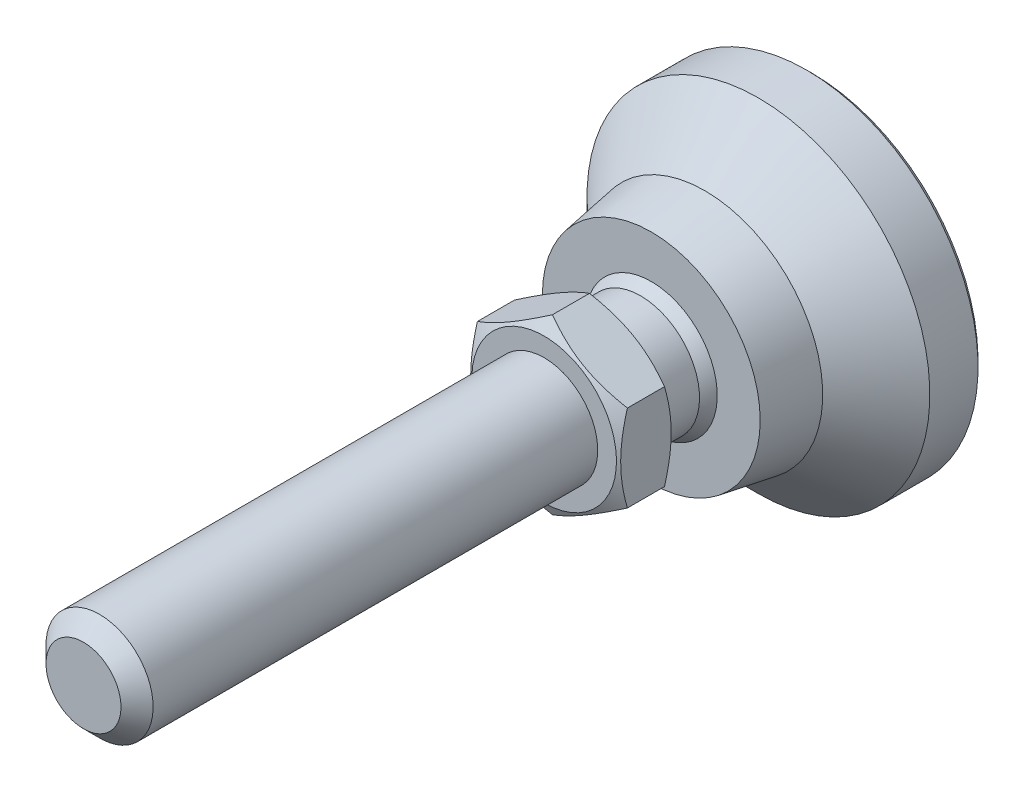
ISO-10303-21;
HEADER;
FILE_DESCRIPTION(('STEP AP214'),'2;1');
FILE_NAME('part.step','',(''),(''),'','','');
FILE_SCHEMA(('AUTOMOTIVE_DESIGN { 1 0 10303 214 1 1 1 1 }'));
ENDSEC;
DATA;
#1=APPLICATION_CONTEXT('core data for automotive mechanical design processes');
#2=APPLICATION_PROTOCOL_DEFINITION('international standard','automotive_design',2000,#1);
#3=PRODUCT_CONTEXT('',#1,'mechanical');
#4=PRODUCT('Part','Part','',(#3));
#5=PRODUCT_RELATED_PRODUCT_CATEGORY('part','',(#4));
#6=PRODUCT_DEFINITION_FORMATION('','',#4);
#7=PRODUCT_DEFINITION_CONTEXT('part definition',#1,'design');
#8=PRODUCT_DEFINITION('design','',#6,#7);
#9=PRODUCT_DEFINITION_SHAPE('','',#8);
#10=(LENGTH_UNIT() NAMED_UNIT(*) SI_UNIT(.MILLI.,.METRE.));
#11=(NAMED_UNIT(*) PLANE_ANGLE_UNIT() SI_UNIT($,.RADIAN.));
#12=(NAMED_UNIT(*) SI_UNIT($,.STERADIAN.) SOLID_ANGLE_UNIT());
#13=UNCERTAINTY_MEASURE_WITH_UNIT(LENGTH_MEASURE(1.E-05),#10,'distance_accuracy_value','');
#14=(GEOMETRIC_REPRESENTATION_CONTEXT(3) GLOBAL_UNCERTAINTY_ASSIGNED_CONTEXT((#13)) GLOBAL_UNIT_ASSIGNED_CONTEXT((#10,
#11,#12)) REPRESENTATION_CONTEXT('',''));
#15=CARTESIAN_POINT('',(0.,0.,0.));
#16=DIRECTION('',(0.,0.,1.));
#17=DIRECTION('',(1.,0.,0.));
#18=AXIS2_PLACEMENT_3D('',#15,#16,#17);
#19=CARTESIAN_POINT('',(0.,0.,0.));
#20=DIRECTION('',(0.,0.,-1.));
#21=DIRECTION('',(0.,1.,0.));
#22=AXIS2_PLACEMENT_3D('',#19,#20,#21);
#23=CYLINDRICAL_SURFACE('',#22,5.49999999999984);
#24=CARTESIAN_POINT('',(0.,0.,20.));
#25=DIRECTION('',(0.,0.,-1.));
#26=DIRECTION('',(0.,1.,0.));
#27=AXIS2_PLACEMENT_3D('',#24,#25,#26);
#28=CIRCLE('',#27,5.49999999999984);
#29=CARTESIAN_POINT('',(0.,5.49999999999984,20.));
#30=VERTEX_POINT('',#29);
#31=EDGE_CURVE('E112',#30,#30,#28,.T.);
#32=ORIENTED_EDGE('',*,*,#31,.T.);
#33=EDGE_LOOP('',(#32));
#34=FACE_BOUND('',#33,.T.);
#35=CARTESIAN_POINT('',(0.,0.,16.0000000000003));
#36=DIRECTION('',(0.,0.,1.));
#37=DIRECTION('',(0.,-1.,0.));
#38=AXIS2_PLACEMENT_3D('',#35,#36,#37);
#39=CIRCLE('',#38,5.49999999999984);
#40=CARTESIAN_POINT('',(-5.49999999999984,0.,16.0000000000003));
#41=VERTEX_POINT('',#40);
#42=EDGE_CURVE('E115',#41,#41,#39,.T.);
#43=ORIENTED_EDGE('',*,*,#42,.T.);
#44=EDGE_LOOP('',(#43));
#45=FACE_BOUND('',#44,.T.);
#46=ADVANCED_FACE('F14',(#34,#45),#23,.T.);
#47=CARTESIAN_POINT('',(0.,0.,11.6698729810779));
#48=DIRECTION('',(0.,0.,1.));
#49=DIRECTION('',(-1.,0.,0.));
#50=AXIS2_PLACEMENT_3D('',#47,#48,#49);
#51=SPHERICAL_SURFACE('',#50,7.);
#52=CARTESIAN_POINT('',(0.,0.,15.));
#53=DIRECTION('',(0.,0.,1.));
#54=DIRECTION('',(0.,-1.,0.));
#55=AXIS2_PLACEMENT_3D('',#52,#53,#54);
#56=CIRCLE('',#55,6.15713034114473);
#57=CARTESIAN_POINT('',(-6.15713034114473,0.,15.));
#58=VERTEX_POINT('',#57);
#59=EDGE_CURVE('E276',#58,#58,#56,.T.);
#60=CARTESIAN_POINT('',(-5.49999999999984,0.,16.0000000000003));
#61=CARTESIAN_POINT('',(-5.50771979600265,0.,15.9901945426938));
#62=CARTESIAN_POINT('',(-5.51541336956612,0.,15.9803684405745));
#63=CARTESIAN_POINT('',(-5.53074785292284,0.,15.9606752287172));
#64=CARTESIAN_POINT('',(-5.53838876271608,0.,15.9508081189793));
#65=CARTESIAN_POINT('',(-5.55361769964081,0.,15.9310331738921));
#66=CARTESIAN_POINT('',(-5.56120572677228,0.,15.9211253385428));
#67=CARTESIAN_POINT('',(-5.57632868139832,0.,15.9012692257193));
#68=CARTESIAN_POINT('',(-5.58386360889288,0.,15.8913209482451));
#69=CARTESIAN_POINT('',(-5.59888014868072,0.,15.871384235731));
#70=CARTESIAN_POINT('',(-5.60636176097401,0.,15.8613958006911));
#71=CARTESIAN_POINT('',(-5.62127145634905,0.,15.841379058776));
#72=CARTESIAN_POINT('',(-5.62869953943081,0.,15.8313507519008));
#73=CARTESIAN_POINT('',(-5.64350196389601,0.,15.81125455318));
#74=CARTESIAN_POINT('',(-5.65087630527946,0.,15.8011866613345));
#75=CARTESIAN_POINT('',(-5.66557103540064,0.,15.781011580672));
#76=CARTESIAN_POINT('',(-5.67289142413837,0.,15.770904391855));
#77=CARTESIAN_POINT('',(-5.68747803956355,0.,15.7506510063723));
#78=CARTESIAN_POINT('',(-5.69474426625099,0.,15.7405048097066));
#79=CARTESIAN_POINT('',(-5.70922234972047,0.,15.7201736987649));
#80=CARTESIAN_POINT('',(-5.7164342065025,0.,15.7099887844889));
#81=CARTESIAN_POINT('',(-5.7308033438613,0.,15.6895805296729));
#82=CARTESIAN_POINT('',(-5.73796062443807,0.,15.6793571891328));
#83=CARTESIAN_POINT('',(-5.75222040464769,0.,15.6588723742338));
#84=CARTESIAN_POINT('',(-5.75932290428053,0.,15.6486108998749));
#85=CARTESIAN_POINT('',(-5.77347291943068,0.,15.6280501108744));
#86=CARTESIAN_POINT('',(-5.78052043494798,0.,15.6177507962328));
#87=CARTESIAN_POINT('',(-5.79456028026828,0.,15.5971146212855));
#88=CARTESIAN_POINT('',(-5.80155261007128,0.,15.5867777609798));
#89=CARTESIAN_POINT('',(-5.81548188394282,0.,15.5660667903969));
#90=CARTESIAN_POINT('',(-5.82241882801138,0.,15.5556926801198));
#91=CARTESIAN_POINT('',(-5.83623713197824,0.,15.5349075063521));
#92=CARTESIAN_POINT('',(-5.84311849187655,0.,15.5244964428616));
#93=CARTESIAN_POINT('',(-5.85682543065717,0.,15.5036376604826));
#94=CARTESIAN_POINT('',(-5.86365100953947,0.,15.493189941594));
#95=CARTESIAN_POINT('',(-5.87724619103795,0.,15.4722581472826));
#96=CARTESIAN_POINT('',(-5.88401579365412,0.,15.4617740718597));
#97=CARTESIAN_POINT('',(-5.89749882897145,0.,15.4407698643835));
#98=CARTESIAN_POINT('',(-5.90421226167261,0.,15.4302497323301));
#99=CARTESIAN_POINT('',(-5.91758276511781,0.,15.4091737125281));
#100=CARTESIAN_POINT('',(-5.92423983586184,0.,15.3986178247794));
#101=CARTESIAN_POINT('',(-5.93749742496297,0.,15.3774705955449));
#102=CARTESIAN_POINT('',(-5.94409794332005,0.,15.366879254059));
#103=CARTESIAN_POINT('',(-5.95724223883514,0.,15.3456614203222));
#104=CARTESIAN_POINT('',(-5.96378601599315,0.,15.3350349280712));
#105=CARTESIAN_POINT('',(-5.9768166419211,0.,15.313747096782));
#106=CARTESIAN_POINT('',(-5.98330349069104,0.,15.3030857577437));
#107=CARTESIAN_POINT('',(-5.99622007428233,0.,15.2817285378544));
#108=CARTESIAN_POINT('',(-6.00264980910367,0.,15.2710326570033));
#109=CARTESIAN_POINT('',(-6.015451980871,0.,15.2496066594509));
#110=CARTESIAN_POINT('',(-6.02182441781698,0.,15.2388765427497));
#111=CARTESIAN_POINT('',(-6.034511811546,0.,15.217382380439));
#112=CARTESIAN_POINT('',(-6.04082676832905,0.,15.2066183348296));
#113=CARTESIAN_POINT('',(-6.05339902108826,0.,15.1850566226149));
#114=CARTESIAN_POINT('',(-6.05965631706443,0.,15.1742589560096));
#115=CARTESIAN_POINT('',(-6.07211306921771,0.,15.1526303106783));
#116=CARTESIAN_POINT('',(-6.07831252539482,0.,15.1417993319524));
#117=CARTESIAN_POINT('',(-6.09065342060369,0.,15.1201043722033));
#118=CARTESIAN_POINT('',(-6.09679485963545,0.,15.1092403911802));
#119=CARTESIAN_POINT('',(-6.10901954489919,0.,15.0874797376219));
#120=CARTESIAN_POINT('',(-6.11510279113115,0.,15.0765830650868));
#121=CARTESIAN_POINT('',(-6.12721091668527,0.,15.054757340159));
#122=CARTESIAN_POINT('',(-6.13323579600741,0.,15.0438282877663));
#123=CARTESIAN_POINT('',(-6.14522701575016,0.,15.0219381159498));
#124=CARTESIAN_POINT('',(-6.15119335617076,0.,15.010976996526));
#125=CARTESIAN_POINT('',(-6.15713034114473,0.,15.));
#126=B_SPLINE_CURVE_WITH_KNOTS('',3,(#60,#61,#62,#63,#64,#65,#66,#67,#68,#69,#70,#71,#72,#73,
#74,#75,#76,#77,#78,#79,#80,#81,#82,#83,#84,#85,#86,#87,#88,#89,#90,#91,#92,#93,#94,#95,#96,#97,
#98,#99,#100,#101,#102,#103,#104,#105,#106,#107,#108,#109,#110,#111,#112,#113,#114,#115,#116,
#117,#118,#119,#120,#121,#122,#123,#124,#125),.UNSPECIFIED.,.F.,.F.,(4,2,2,2,2,2,2,2,2,2,2,2,2,
2,2,2,2,2,2,2,2,2,2,2,2,2,2,2,2,2,2,2,4),(0.,0.0374389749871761,0.0748779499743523,
0.112316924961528,0.149755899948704,0.18719487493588,0.224633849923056,0.26207282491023,
0.299511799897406,0.336950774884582,0.374389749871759,0.411828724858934,0.449267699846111,
0.486706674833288,0.524145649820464,0.56158462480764,0.599023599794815,0.636462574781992,
0.673901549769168,0.711340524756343,0.74877949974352,0.786218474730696,0.823657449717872,
0.861096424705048,0.898535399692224,0.9359743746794,0.973413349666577,1.01085232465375,
1.04829129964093,1.0857302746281,1.12316924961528,1.16060822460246,1.19804719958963),.UNSPECIFIED.);
#127=EDGE_CURVE('BSEAM243',#41,#58,#126,.T.);
#128=ORIENTED_EDGE('',*,*,#42,.F.);
#129=ORIENTED_EDGE('',*,*,#59,.T.);
#130=ORIENTED_EDGE('',*,*,#127,.T.);
#131=ORIENTED_EDGE('',*,*,#127,.F.);
#132=EDGE_LOOP('',(#128,#130,#129,#131));
#133=FACE_BOUND('',#132,.T.);
#134=ADVANCED_FACE('F243',(#133),#51,.T.);
#135=CARTESIAN_POINT('',(-15.5,0.,0.));
#136=DIRECTION('',(0.,0.,1.));
#137=DIRECTION('',(0.,-1.,0.));
#138=AXIS2_PLACEMENT_3D('',#135,#136,#137);
#139=PLANE('',#138);
#140=CARTESIAN_POINT('',(0.,0.,0.));
#141=DIRECTION('',(0.,0.,-1.));
#142=DIRECTION('',(0.,1.,0.));
#143=AXIS2_PLACEMENT_3D('',#140,#141,#142);
#144=CIRCLE('',#143,15.5);
#145=CARTESIAN_POINT('',(0.,15.5,0.));
#146=VERTEX_POINT('',#145);
#147=EDGE_CURVE('E85',#146,#146,#144,.T.);
#148=ORIENTED_EDGE('',*,*,#147,.T.);
#149=EDGE_LOOP('',(#148));
#150=FACE_BOUND('',#149,.T.);
#151=ADVANCED_FACE('F246',(#150),#139,.F.);
#152=CARTESIAN_POINT('',(0.,0.,0.500000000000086));
#153=DIRECTION('',(0.,0.,1.));
#154=DIRECTION('',(0.,-1.,0.));
#155=AXIS2_PLACEMENT_3D('',#152,#153,#154);
#156=CONICAL_SURFACE('',#155,16.,0.785398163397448);
#157=ORIENTED_EDGE('',*,*,#147,.F.);
#158=EDGE_LOOP('',(#157));
#159=FACE_BOUND('',#158,.T.);
#160=CARTESIAN_POINT('',(0.,0.,0.500000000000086));
#161=DIRECTION('',(0.,0.,-1.));
#162=DIRECTION('',(0.,1.,0.));
#163=AXIS2_PLACEMENT_3D('',#160,#161,#162);
#164=CIRCLE('',#163,16.);
#165=CARTESIAN_POINT('',(0.,16.,0.500000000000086));
#166=VERTEX_POINT('',#165);
#167=EDGE_CURVE('E88',#166,#166,#164,.T.);
#168=ORIENTED_EDGE('',*,*,#167,.T.);
#169=EDGE_LOOP('',(#168));
#170=FACE_BOUND('',#169,.T.);
#171=ADVANCED_FACE('F361',(#159,#170),#156,.T.);
#172=CARTESIAN_POINT('',(0.,0.,0.));
#173=DIRECTION('',(0.,0.,-1.));
#174=DIRECTION('',(0.,1.,0.));
#175=AXIS2_PLACEMENT_3D('',#172,#173,#174);
#176=CYLINDRICAL_SURFACE('',#175,16.);
#177=ORIENTED_EDGE('',*,*,#167,.F.);
#178=EDGE_LOOP('',(#177));
#179=FACE_BOUND('',#178,.T.);
#180=CARTESIAN_POINT('',(0.,0.,5.00000000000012));
#181=DIRECTION('',(0.,0.,-1.));
#182=DIRECTION('',(0.,1.,0.));
#183=AXIS2_PLACEMENT_3D('',#180,#181,#182);
#184=CIRCLE('',#183,16.);
#185=CARTESIAN_POINT('',(0.,16.,5.00000000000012));
#186=VERTEX_POINT('',#185);
#187=EDGE_CURVE('E105',#186,#186,#184,.T.);
#188=ORIENTED_EDGE('',*,*,#187,.T.);
#189=EDGE_LOOP('',(#188));
#190=FACE_BOUND('',#189,.T.);
#191=ADVANCED_FACE('F368',(#179,#190),#176,.T.);
#192=CARTESIAN_POINT('',(0.,0.,10.));
#193=DIRECTION('',(0.,0.,-1.));
#194=DIRECTION('',(0.,1.,0.));
#195=AXIS2_PLACEMENT_3D('',#192,#193,#194);
#196=CONICAL_SURFACE('',#195,11.,0.785398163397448);
#197=ORIENTED_EDGE('',*,*,#187,.F.);
#198=EDGE_LOOP('',(#197));
#199=FACE_BOUND('',#198,.T.);
#200=CARTESIAN_POINT('',(0.,0.,10.));
#201=DIRECTION('',(0.,0.,-1.));
#202=DIRECTION('',(0.,1.,0.));
#203=AXIS2_PLACEMENT_3D('',#200,#201,#202);
#204=CIRCLE('',#203,11.);
#205=CARTESIAN_POINT('',(0.,11.,10.));
#206=VERTEX_POINT('',#205);
#207=EDGE_CURVE('E108',#206,#206,#204,.T.);
#208=ORIENTED_EDGE('',*,*,#207,.T.);
#209=EDGE_LOOP('',(#208));
#210=FACE_BOUND('',#209,.T.);
#211=ADVANCED_FACE('F376',(#199,#210),#196,.T.);
#212=CARTESIAN_POINT('',(0.,0.,16.));
#213=DIRECTION('',(0.,0.,-1.));
#214=DIRECTION('',(0.,1.,0.));
#215=AXIS2_PLACEMENT_3D('',#212,#213,#214);
#216=CONICAL_SURFACE('',#215,10.,0.165148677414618);
#217=ORIENTED_EDGE('',*,*,#207,.F.);
#218=EDGE_LOOP('',(#217));
#219=FACE_BOUND('',#218,.T.);
#220=CARTESIAN_POINT('',(0.,0.,15.));
#221=DIRECTION('',(0.,0.,-1.));
#222=DIRECTION('',(0.,1.,0.));
#223=AXIS2_PLACEMENT_3D('',#220,#221,#222);
#224=CIRCLE('',#223,10.1666666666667);
#225=CARTESIAN_POINT('',(0.,10.1666666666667,15.));
#226=VERTEX_POINT('',#225);
#227=EDGE_CURVE('E93',#226,#226,#224,.T.);
#228=ORIENTED_EDGE('',*,*,#227,.T.);
#229=EDGE_LOOP('',(#228));
#230=FACE_BOUND('',#229,.T.);
#231=ADVANCED_FACE('F241',(#219,#230),#216,.T.);
#232=CARTESIAN_POINT('',(-10.1666666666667,0.,15.));
#233=DIRECTION('',(0.,0.,1.));
#234=DIRECTION('',(0.,-1.,0.));
#235=AXIS2_PLACEMENT_3D('',#232,#233,#234);
#236=PLANE('',#235);
#237=ORIENTED_EDGE('',*,*,#227,.F.);
#238=EDGE_LOOP('',(#237));
#239=FACE_BOUND('',#238,.T.);
#240=ORIENTED_EDGE('',*,*,#59,.F.);
#241=EDGE_LOOP('',(#240));
#242=FACE_BOUND('',#241,.T.);
#243=ADVANCED_FACE('F236',(#239,#242),#236,.T.);
#244=CARTESIAN_POINT('',(0.,-8.08290376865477,20.));
#245=DIRECTION('',(0.,0.,-1.));
#246=DIRECTION('',(0.,1.,0.));
#247=AXIS2_PLACEMENT_3D('',#244,#245,#246);
#248=PLANE('',#247);
#249=CARTESIAN_POINT('',(0.,0.,20.));
#250=DIRECTION('',(0.,0.,1.));
#251=DIRECTION('',(0.,-1.,0.));
#252=AXIS2_PLACEMENT_3D('',#249,#250,#251);
#253=CIRCLE('',#252,6.75);
#254=CARTESIAN_POINT('',(0.,-6.75,20.));
#255=VERTEX_POINT('',#254);
#256=EDGE_CURVE('E80',#255,#255,#253,.T.);
#257=ORIENTED_EDGE('',*,*,#256,.F.);
#258=EDGE_LOOP('',(#257));
#259=FACE_BOUND('',#258,.T.);
#260=ORIENTED_EDGE('',*,*,#31,.F.);
#261=EDGE_LOOP('',(#260));
#262=FACE_BOUND('',#261,.T.);
#263=ADVANCED_FACE('F240',(#259,#262),#248,.T.);
#264=CARTESIAN_POINT('',(0.,0.,20.));
#265=DIRECTION('',(0.,0.,1.));
#266=DIRECTION('',(0.,-1.,0.));
#267=AXIS2_PLACEMENT_3D('',#264,#265,#266);
#268=CONICAL_SURFACE('',#267,6.75,1.0471975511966);
#269=CARTESIAN_POINT('',(7.0002,-4.04133641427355,20.7696190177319));
#270=CARTESIAN_POINT('',(6.84633209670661,-4.13017208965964,20.7183374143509));
#271=CARTESIAN_POINT('',(6.69189049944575,-4.21933898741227,20.669383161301));
#272=CARTESIAN_POINT('',(6.38175307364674,-4.3983969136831,20.5767703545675));
#273=CARTESIAN_POINT('',(6.22605673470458,-4.4882882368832,20.5331140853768));
#274=CARTESIAN_POINT('',(5.75647483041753,-4.7594014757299,20.4109491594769));
#275=CARTESIAN_POINT('',(5.4407356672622,-4.94169356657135,20.3414631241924));
#276=CARTESIAN_POINT('',(4.96823775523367,-5.21449036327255,20.2599825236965));
#277=CARTESIAN_POINT('',(4.81289077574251,-5.30417998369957,20.2367710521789));
#278=CARTESIAN_POINT('',(4.50149488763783,-5.48396448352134,20.1978487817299));
#279=CARTESIAN_POINT('',(4.34544604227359,-5.57405932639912,20.1821373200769));
#280=CARTESIAN_POINT('',(4.03307732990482,-5.75440548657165,20.1586154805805));
#281=CARTESIAN_POINT('',(3.87675797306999,-5.84465650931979,20.1507961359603));
#282=CARTESIAN_POINT('',(3.56398349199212,-6.02523694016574,20.1432178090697));
#283=CARTESIAN_POINT('',(3.40752837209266,-6.11556634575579,20.1434585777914));
#284=CARTESIAN_POINT('',(2.97889312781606,-6.36303901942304,20.155197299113));
#285=CARTESIAN_POINT('',(2.7068533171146,-6.52010127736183,20.1749033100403));
#286=CARTESIAN_POINT('',(2.1645805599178,-6.8331825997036,20.2373910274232));
#287=CARTESIAN_POINT('',(1.89434952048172,-6.98920056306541,20.2801940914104));
#288=CARTESIAN_POINT('',(1.35098545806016,-7.30291195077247,20.3871892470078));
#289=CARTESIAN_POINT('',(1.07792099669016,-7.46056579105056,20.4518346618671));
#290=CARTESIAN_POINT('',(0.535864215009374,-7.77352241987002,20.5985536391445));
#291=CARTESIAN_POINT('',(0.266864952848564,-7.92882921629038,20.680592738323));
#292=CARTESIAN_POINT('',(-0.000199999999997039,-8.08301923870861,20.7696190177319));
#293=B_SPLINE_CURVE_WITH_KNOTS('',3,(#269,#270,#271,#272,#273,#274,#275,#276,#277,#278,#279,
#280,#281,#282,#283,#284,#285,#286,#287,#288,#289,#290,#291,#292),.UNSPECIFIED.,.F.,.F.,(4,2,2,
2,2,2,2,2,2,2,2,4),(0.,0.554727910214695,1.10969417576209,2.2219327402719,2.76443041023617,
3.30688013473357,3.8487128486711,4.39052882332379,5.33376515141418,6.27787517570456,
7.24292418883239,8.20607866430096),.UNSPECIFIED.);
#294=CARTESIAN_POINT('',(7.,-4.04145188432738,20.7695523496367));
#295=VERTEX_POINT('',#294);
#296=CARTESIAN_POINT('',(0.,-8.08290376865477,20.7695523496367));
#297=VERTEX_POINT('',#296);
#298=EDGE_CURVE('E33',#295,#297,#293,.T.);
#299=ORIENTED_EDGE('',*,*,#298,.T.);
#300=CARTESIAN_POINT('',(0.000200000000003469,-8.0830192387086,20.7696190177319));
#301=CARTESIAN_POINT('',(-0.153667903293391,-7.99418356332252,20.7183374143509));
#302=CARTESIAN_POINT('',(-0.308109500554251,-7.90501666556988,20.669383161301));
#303=CARTESIAN_POINT('',(-0.618246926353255,-7.72595873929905,20.5767703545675));
#304=CARTESIAN_POINT('',(-0.773943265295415,-7.63606741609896,20.5331140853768));
#305=CARTESIAN_POINT('',(-1.24352516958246,-7.36495417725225,20.4109491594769));
#306=CARTESIAN_POINT('',(-1.5592643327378,-7.18266208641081,20.3414631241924));
#307=CARTESIAN_POINT('',(-2.03176224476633,-6.90986528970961,20.2599825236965));
#308=CARTESIAN_POINT('',(-2.18710922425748,-6.82017566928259,20.2367710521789));
#309=CARTESIAN_POINT('',(-2.49850511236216,-6.64039116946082,20.1978487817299));
#310=CARTESIAN_POINT('',(-2.6545539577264,-6.55029632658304,20.1821373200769));
#311=CARTESIAN_POINT('',(-2.96692267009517,-6.36995016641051,20.1586154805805));
#312=CARTESIAN_POINT('',(-3.12324202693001,-6.27969914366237,20.1507961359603));
#313=CARTESIAN_POINT('',(-3.43601650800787,-6.09911871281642,20.1432178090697));
#314=CARTESIAN_POINT('',(-3.59247162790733,-6.00878930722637,20.1434585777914));
#315=CARTESIAN_POINT('',(-4.02110687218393,-5.76131663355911,20.155197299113));
#316=CARTESIAN_POINT('',(-4.29314668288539,-5.60425437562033,20.1749033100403));
#317=CARTESIAN_POINT('',(-4.83541944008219,-5.29117305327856,20.2373910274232));
#318=CARTESIAN_POINT('',(-5.10565047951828,-5.13515508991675,20.2801940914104));
#319=CARTESIAN_POINT('',(-5.64901454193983,-4.82144370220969,20.3871892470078));
#320=CARTESIAN_POINT('',(-5.92207900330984,-4.6637898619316,20.4518346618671));
#321=CARTESIAN_POINT('',(-6.46413578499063,-4.35083323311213,20.5985536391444));
#322=CARTESIAN_POINT('',(-6.73313504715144,-4.19552643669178,20.680592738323));
#323=CARTESIAN_POINT('',(-7.0002,-4.04133641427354,20.7696190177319));
#324=B_SPLINE_CURVE_WITH_KNOTS('',3,(#300,#301,#302,#303,#304,#305,#306,#307,#308,#309,#310,
#311,#312,#313,#314,#315,#316,#317,#318,#319,#320,#321,#322,#323),.UNSPECIFIED.,.F.,.F.,(4,2,2,
2,2,2,2,2,2,2,2,4),(0.,0.554727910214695,1.10969417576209,2.2219327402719,2.76443041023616,
3.30688013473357,3.84871284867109,4.39052882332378,5.33376515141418,6.27787517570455,
7.2429241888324,8.20607866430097),.UNSPECIFIED.);
#325=CARTESIAN_POINT('',(-7.,-4.04145188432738,20.7695523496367));
#326=VERTEX_POINT('',#325);
#327=EDGE_CURVE('E9',#297,#326,#324,.T.);
#328=ORIENTED_EDGE('',*,*,#327,.T.);
#329=CARTESIAN_POINT('',(-7.,10.8673070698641,23.5660923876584));
#330=CARTESIAN_POINT('',(-7.,10.5614739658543,23.4176898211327));
#331=CARTESIAN_POINT('',(-7.,10.2549400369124,23.270706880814));
#332=CARTESIAN_POINT('',(-7.,9.64009786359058,22.9803784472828));
#333=CARTESIAN_POINT('',(-7.,9.33178934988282,22.837033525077));
#334=CARTESIAN_POINT('',(-7.,8.71144236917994,22.5540606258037));
#335=CARTESIAN_POINT('',(-7.,8.39939274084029,22.4144570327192));
#336=CARTESIAN_POINT('',(-7.,7.77281561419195,22.1409475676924));
#337=CARTESIAN_POINT('',(-7.,7.45828823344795,22.0070414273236));
#338=CARTESIAN_POINT('',(-7.,6.81605976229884,21.7422267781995));
#339=CARTESIAN_POINT('',(-7.,6.48826088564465,21.6115541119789));
#340=CARTESIAN_POINT('',(-7.,5.82883314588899,21.3600707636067));
#341=CARTESIAN_POINT('',(-7.,5.49720385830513,21.2392611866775));
#342=CARTESIAN_POINT('',(-7.,4.83020067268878,21.0106674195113));
#343=CARTESIAN_POINT('',(-7.,4.49483587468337,20.9028569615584));
#344=CARTESIAN_POINT('',(-7.,3.81930761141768,20.7037119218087));
#345=CARTESIAN_POINT('',(-7.,3.47914569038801,20.6123721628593));
#346=CARTESIAN_POINT('',(-7.,2.79566346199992,20.4510366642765));
#347=CARTESIAN_POINT('',(-7.,2.45237132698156,20.3809247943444));
#348=CARTESIAN_POINT('',(-7.,1.93429740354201,20.2947073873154));
#349=CARTESIAN_POINT('',(-7.,1.76107064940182,20.2691254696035));
#350=CARTESIAN_POINT('',(-7.,1.4137530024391,20.2247800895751));
#351=CARTESIAN_POINT('',(-7.,1.23966219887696,20.2060159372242));
#352=CARTESIAN_POINT('',(-7.,0.893127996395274,20.1759156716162));
#353=CARTESIAN_POINT('',(-7.,0.720692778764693,20.164485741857));
#354=CARTESIAN_POINT('',(-7.,0.375493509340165,20.1489286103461));
#355=CARTESIAN_POINT('',(-7.,0.20272946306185,20.1448012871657));
#356=CARTESIAN_POINT('',(-7.,-0.142818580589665,20.1439478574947));
#357=CARTESIAN_POINT('',(-7.,-0.315602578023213,20.1472217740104));
#358=CARTESIAN_POINT('',(-7.,-0.660878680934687,20.1610906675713));
#359=CARTESIAN_POINT('',(-7.,-0.8333707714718,20.1716860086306));
#360=CARTESIAN_POINT('',(-7.,-1.247569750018,20.2056942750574));
#361=CARTESIAN_POINT('',(-7.,-1.48899903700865,20.232561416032));
#362=CARTESIAN_POINT('',(-7.,-1.97006195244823,20.2991754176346));
#363=CARTESIAN_POINT('',(-7.,-2.20969533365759,20.3389240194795));
#364=CARTESIAN_POINT('',(-7.,-2.92562959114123,20.4753840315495));
#365=CARTESIAN_POINT('',(-7.,-3.3986972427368,20.589284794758));
#366=CARTESIAN_POINT('',(-7.,-4.10607923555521,20.7867579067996));
#367=CARTESIAN_POINT('',(-7.,-4.34406361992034,20.8579393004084));
#368=CARTESIAN_POINT('',(-7.,-4.81772085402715,21.0076853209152));
#369=CARTESIAN_POINT('',(-7.,-5.05339368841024,21.0862499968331));
#370=CARTESIAN_POINT('',(-7.,-5.52250218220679,21.2495028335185));
#371=CARTESIAN_POINT('',(-7.,-5.75593855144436,21.3341889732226));
#372=CARTESIAN_POINT('',(-7.,-6.22087778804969,21.5086892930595));
#373=CARTESIAN_POINT('',(-7.,-6.45238067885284,21.5985034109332));
#374=CARTESIAN_POINT('',(-7.,-7.00187574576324,21.8175742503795));
#375=CARTESIAN_POINT('',(-7.,-7.31908929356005,21.9487804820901));
#376=CARTESIAN_POINT('',(-7.,-7.95079328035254,22.2176111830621));
#377=CARTESIAN_POINT('',(-7.,-8.26528354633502,22.3552360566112));
#378=CARTESIAN_POINT('',(-7.,-8.89204677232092,22.6356045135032));
#379=CARTESIAN_POINT('',(-7.,-9.20431925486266,22.7783491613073));
#380=CARTESIAN_POINT('',(-7.,-9.8269675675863,23.0679241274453));
#381=CARTESIAN_POINT('',(-7.,-10.1373433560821,23.2147545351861));
#382=CARTESIAN_POINT('',(-7.,-10.7568437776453,23.5118875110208));
#383=CARTESIAN_POINT('',(-7.,-11.0659666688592,23.6621937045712));
#384=CARTESIAN_POINT('',(-7.,-11.6828746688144,23.9655293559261));
#385=CARTESIAN_POINT('',(-7.,-11.9906597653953,24.118558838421));
#386=CARTESIAN_POINT('',(-7.,-12.9122459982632,24.5809605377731));
#387=CARTESIAN_POINT('',(-7.,-13.5243637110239,24.8936874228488));
#388=CARTESIAN_POINT('',(-7.,-14.693512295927,25.49859838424));
#389=CARTESIAN_POINT('',(-7.,-15.2508081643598,25.7902725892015));
#390=CARTESIAN_POINT('',(-7.,-16.3633346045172,26.377579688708));
#391=CARTESIAN_POINT('',(-7.,-16.9185650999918,26.6732127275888));
#392=CARTESIAN_POINT('',(-7.,-18.0260073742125,27.2667340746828));
#393=CARTESIAN_POINT('',(-7.,-18.5782232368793,27.5646147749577));
#394=CARTESIAN_POINT('',(-7.,-19.6813365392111,28.1627347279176));
#395=CARTESIAN_POINT('',(-7.,-20.2322340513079,28.4629738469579));
#396=CARTESIAN_POINT('',(-7.,-20.782647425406,28.7640919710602));
#397=B_SPLINE_CURVE_WITH_KNOTS('',3,(#329,#330,#331,#332,#333,#334,#335,#336,#337,#338,#339,
#340,#341,#342,#343,#344,#345,#346,#347,#348,#349,#350,#351,#352,#353,#354,#355,#356,#357,#358,
#359,#360,#361,#362,#363,#364,#365,#366,#367,#368,#369,#370,#371,#372,#373,#374,#375,#376,#377,
#378,#379,#380,#381,#382,#383,#384,#385,#386,#387,#388,#389,#390,#391,#392,#393,#394,#395,#396),
.UNSPECIFIED.,.F.,.F.,(4,2,2,2,2,2,2,2,2,2,2,2,2,2,2,2,2,2,2,2,2,2,2,2,2,2,2,2,2,2,2,2,2,4),(0.,
1.0198235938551,2.03980627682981,3.06532252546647,4.09079040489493,5.14932064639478,
6.20796934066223,7.26444160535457,8.32058121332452,9.37083407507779,9.89603758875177,
10.4211879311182,10.9394792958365,11.4577620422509,11.9760463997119,12.4943565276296,
13.2227040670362,13.9511500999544,15.4088440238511,16.153986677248,16.8991342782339,
17.6440369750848,18.3889306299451,19.4186676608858,20.4484696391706,21.4784869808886,
22.5085268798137,23.5396945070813,24.5708714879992,26.632940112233,28.5199506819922,
30.4070302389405,32.2893305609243,34.1715249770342),.UNSPECIFIED.);
#398=CARTESIAN_POINT('',(-7.,4.04145188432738,20.7695523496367));
#399=VERTEX_POINT('',#398);
#400=EDGE_CURVE('E72',#326,#399,#397,.F.);
#401=ORIENTED_EDGE('',*,*,#400,.T.);
#402=CARTESIAN_POINT('',(-7.0002,4.04133641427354,20.7696190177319));
#403=CARTESIAN_POINT('',(-6.84633209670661,4.13017208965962,20.7183374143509));
#404=CARTESIAN_POINT('',(-6.69189049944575,4.21933898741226,20.669383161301));
#405=CARTESIAN_POINT('',(-6.38175307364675,4.39839691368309,20.5767703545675));
#406=CARTESIAN_POINT('',(-6.22605673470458,4.48828823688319,20.5331140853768));
#407=CARTESIAN_POINT('',(-5.75647483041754,4.75940147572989,20.4109491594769));
#408=CARTESIAN_POINT('',(-5.4407356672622,4.94169356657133,20.3414631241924));
#409=CARTESIAN_POINT('',(-4.96823775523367,5.21449036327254,20.2599825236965));
#410=CARTESIAN_POINT('',(-4.81289077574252,5.30417998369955,20.2367710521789));
#411=CARTESIAN_POINT('',(-4.50149488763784,5.48396448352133,20.1978487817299));
#412=CARTESIAN_POINT('',(-4.34544604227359,5.57405932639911,20.1821373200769));
#413=CARTESIAN_POINT('',(-4.03307732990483,5.75440548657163,20.1586154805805));
#414=CARTESIAN_POINT('',(-3.87675797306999,5.84465650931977,20.1507961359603));
#415=CARTESIAN_POINT('',(-3.56398349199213,6.02523694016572,20.1432178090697));
#416=CARTESIAN_POINT('',(-3.40752837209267,6.11556634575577,20.1434585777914));
#417=CARTESIAN_POINT('',(-2.97889312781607,6.36303901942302,20.155197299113));
#418=CARTESIAN_POINT('',(-2.7068533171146,6.52010127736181,20.1749033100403));
#419=CARTESIAN_POINT('',(-2.16458055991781,6.83318259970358,20.2373910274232));
#420=CARTESIAN_POINT('',(-1.89434952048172,6.9892005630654,20.2801940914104));
#421=CARTESIAN_POINT('',(-1.35098545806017,7.30291195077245,20.3871892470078));
#422=CARTESIAN_POINT('',(-1.07792099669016,7.46056579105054,20.4518346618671));
#423=CARTESIAN_POINT('',(-0.535864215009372,7.77352241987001,20.5985536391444));
#424=CARTESIAN_POINT('',(-0.266864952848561,7.92882921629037,20.680592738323));
#425=CARTESIAN_POINT('',(0.000199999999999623,8.0830192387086,20.7696190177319));
#426=B_SPLINE_CURVE_WITH_KNOTS('',3,(#402,#403,#404,#405,#406,#407,#408,#409,#410,#411,#412,
#413,#414,#415,#416,#417,#418,#419,#420,#421,#422,#423,#424,#425),.UNSPECIFIED.,.F.,.F.,(4,2,2,
2,2,2,2,2,2,2,2,4),(0.,0.554727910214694,1.10969417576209,2.2219327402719,2.76443041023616,
3.30688013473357,3.84871284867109,4.39052882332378,5.33376515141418,6.27787517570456,
7.2429241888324,8.20607866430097),.UNSPECIFIED.);
#427=CARTESIAN_POINT('',(0.,8.08290376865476,20.7695523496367));
#428=VERTEX_POINT('',#427);
#429=EDGE_CURVE('E79',#399,#428,#426,.T.);
#430=ORIENTED_EDGE('',*,*,#429,.T.);
#431=CARTESIAN_POINT('',(-0.000200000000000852,8.0830192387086,20.7696190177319));
#432=CARTESIAN_POINT('',(0.15366790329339,7.99418356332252,20.7183374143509));
#433=CARTESIAN_POINT('',(0.308109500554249,7.90501666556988,20.669383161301));
#434=CARTESIAN_POINT('',(0.618246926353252,7.72595873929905,20.5767703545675));
#435=CARTESIAN_POINT('',(0.773943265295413,7.63606741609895,20.5331140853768));
#436=CARTESIAN_POINT('',(1.24352516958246,7.36495417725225,20.4109491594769));
#437=CARTESIAN_POINT('',(1.5592643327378,7.18266208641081,20.3414631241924));
#438=CARTESIAN_POINT('',(2.03176224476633,6.9098652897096,20.2599825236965));
#439=CARTESIAN_POINT('',(2.18710922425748,6.82017566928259,20.2367710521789));
#440=CARTESIAN_POINT('',(2.49850511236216,6.64039116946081,20.1978487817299));
#441=CARTESIAN_POINT('',(2.65455395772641,6.55029632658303,20.1821373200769));
#442=CARTESIAN_POINT('',(2.96692267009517,6.36995016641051,20.1586154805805));
#443=CARTESIAN_POINT('',(3.12324202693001,6.27969914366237,20.1507961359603));
#444=CARTESIAN_POINT('',(3.43601650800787,6.09911871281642,20.1432178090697));
#445=CARTESIAN_POINT('',(3.59247162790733,6.00878930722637,20.1434585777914));
#446=CARTESIAN_POINT('',(4.02110687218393,5.76131663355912,20.155197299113));
#447=CARTESIAN_POINT('',(4.2931466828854,5.60425437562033,20.1749033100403));
#448=CARTESIAN_POINT('',(4.83541944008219,5.29117305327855,20.2373910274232));
#449=CARTESIAN_POINT('',(5.10565047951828,5.13515508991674,20.2801940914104));
#450=CARTESIAN_POINT('',(5.64901454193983,4.82144370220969,20.3871892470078));
#451=CARTESIAN_POINT('',(5.92207900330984,4.66378986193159,20.4518346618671));
#452=CARTESIAN_POINT('',(6.46413578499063,4.35083323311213,20.5985536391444));
#453=CARTESIAN_POINT('',(6.73313504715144,4.19552643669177,20.680592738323));
#454=CARTESIAN_POINT('',(7.0002,4.04133641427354,20.7696190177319));
#455=B_SPLINE_CURVE_WITH_KNOTS('',3,(#431,#432,#433,#434,#435,#436,#437,#438,#439,#440,#441,
#442,#443,#444,#445,#446,#447,#448,#449,#450,#451,#452,#453,#454),.UNSPECIFIED.,.F.,.F.,(4,2,2,
2,2,2,2,2,2,2,2,4),(0.,0.554727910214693,1.10969417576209,2.2219327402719,2.76443041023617,
3.30688013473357,3.8487128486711,4.39052882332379,5.33376515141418,6.27787517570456,
7.2429241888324,8.20607866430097),.UNSPECIFIED.);
#456=CARTESIAN_POINT('',(7.,4.04145188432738,20.7695523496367));
#457=VERTEX_POINT('',#456);
#458=EDGE_CURVE('E194',#428,#457,#455,.T.);
#459=ORIENTED_EDGE('',*,*,#458,.T.);
#460=CARTESIAN_POINT('',(7.,10.8673070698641,23.5660923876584));
#461=CARTESIAN_POINT('',(7.,10.5614739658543,23.4176898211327));
#462=CARTESIAN_POINT('',(7.,10.2549400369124,23.270706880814));
#463=CARTESIAN_POINT('',(7.,9.6400978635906,22.9803784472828));
#464=CARTESIAN_POINT('',(7.,9.33178934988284,22.837033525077));
#465=CARTESIAN_POINT('',(7.,8.71144236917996,22.5540606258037));
#466=CARTESIAN_POINT('',(7.,8.39939274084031,22.4144570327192));
#467=CARTESIAN_POINT('',(7.,7.77281561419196,22.1409475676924));
#468=CARTESIAN_POINT('',(7.,7.45828823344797,22.0070414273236));
#469=CARTESIAN_POINT('',(7.,6.81605976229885,21.7422267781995));
#470=CARTESIAN_POINT('',(7.,6.48826088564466,21.6115541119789));
#471=CARTESIAN_POINT('',(7.,5.828833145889,21.3600707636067));
#472=CARTESIAN_POINT('',(7.,5.49720385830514,21.2392611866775));
#473=CARTESIAN_POINT('',(7.,4.83020067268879,21.0106674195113));
#474=CARTESIAN_POINT('',(7.,4.49483587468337,20.9028569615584));
#475=CARTESIAN_POINT('',(7.,3.81930761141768,20.7037119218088));
#476=CARTESIAN_POINT('',(7.,3.47914569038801,20.6123721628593));
#477=CARTESIAN_POINT('',(7.,2.79566346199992,20.4510366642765));
#478=CARTESIAN_POINT('',(7.,2.45237132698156,20.3809247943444));
#479=CARTESIAN_POINT('',(7.,1.93429740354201,20.2947073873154));
#480=CARTESIAN_POINT('',(7.,1.76107064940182,20.2691254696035));
#481=CARTESIAN_POINT('',(7.,1.4137530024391,20.2247800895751));
#482=CARTESIAN_POINT('',(7.,1.23966219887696,20.2060159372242));
#483=CARTESIAN_POINT('',(7.,0.893127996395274,20.1759156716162));
#484=CARTESIAN_POINT('',(7.,0.720692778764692,20.164485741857));
#485=CARTESIAN_POINT('',(7.,0.375493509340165,20.1489286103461));
#486=CARTESIAN_POINT('',(7.,0.20272946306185,20.1448012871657));
#487=CARTESIAN_POINT('',(7.,-0.142818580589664,20.1439478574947));
#488=CARTESIAN_POINT('',(7.,-0.315602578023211,20.1472217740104));
#489=CARTESIAN_POINT('',(7.,-0.660878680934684,20.1610906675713));
#490=CARTESIAN_POINT('',(7.,-0.833370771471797,20.1716860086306));
#491=CARTESIAN_POINT('',(7.,-1.247569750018,20.2056942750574));
#492=CARTESIAN_POINT('',(7.,-1.48899903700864,20.232561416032));
#493=CARTESIAN_POINT('',(7.,-1.97006195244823,20.2991754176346));
#494=CARTESIAN_POINT('',(7.,-2.20969533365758,20.3389240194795));
#495=CARTESIAN_POINT('',(7.,-2.92562959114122,20.4753840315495));
#496=CARTESIAN_POINT('',(7.,-3.39869724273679,20.589284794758));
#497=CARTESIAN_POINT('',(7.,-4.10607923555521,20.7867579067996));
#498=CARTESIAN_POINT('',(7.,-4.34406361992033,20.8579393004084));
#499=CARTESIAN_POINT('',(7.,-4.81772085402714,21.0076853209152));
#500=CARTESIAN_POINT('',(7.,-5.05339368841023,21.0862499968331));
#501=CARTESIAN_POINT('',(7.,-5.52250218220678,21.2495028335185));
#502=CARTESIAN_POINT('',(7.,-5.75593855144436,21.3341889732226));
#503=CARTESIAN_POINT('',(7.,-6.22087778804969,21.5086892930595));
#504=CARTESIAN_POINT('',(7.,-6.45238067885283,21.5985034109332));
#505=CARTESIAN_POINT('',(7.,-7.00187574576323,21.8175742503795));
#506=CARTESIAN_POINT('',(7.,-7.31908929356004,21.9487804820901));
#507=CARTESIAN_POINT('',(7.,-7.95079328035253,22.2176111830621));
#508=CARTESIAN_POINT('',(7.,-8.26528354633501,22.3552360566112));
#509=CARTESIAN_POINT('',(7.,-8.89204677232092,22.6356045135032));
#510=CARTESIAN_POINT('',(7.,-9.20431925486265,22.7783491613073));
#511=CARTESIAN_POINT('',(7.,-9.82696756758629,23.0679241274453));
#512=CARTESIAN_POINT('',(7.,-10.1373433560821,23.2147545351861));
#513=CARTESIAN_POINT('',(7.,-10.7568437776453,23.5118875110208));
#514=CARTESIAN_POINT('',(7.,-11.0659666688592,23.6621937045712));
#515=CARTESIAN_POINT('',(7.,-11.6828746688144,23.9655293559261));
#516=CARTESIAN_POINT('',(7.,-11.9906597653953,24.118558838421));
#517=CARTESIAN_POINT('',(7.,-12.9122459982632,24.5809605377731));
#518=CARTESIAN_POINT('',(7.,-13.5243637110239,24.8936874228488));
#519=CARTESIAN_POINT('',(7.,-14.693512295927,25.49859838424));
#520=CARTESIAN_POINT('',(7.,-15.2508081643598,25.7902725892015));
#521=CARTESIAN_POINT('',(7.,-16.3633346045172,26.377579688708));
#522=CARTESIAN_POINT('',(7.,-16.9185650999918,26.6732127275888));
#523=CARTESIAN_POINT('',(7.,-18.0260073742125,27.2667340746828));
#524=CARTESIAN_POINT('',(7.,-18.5782232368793,27.5646147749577));
#525=CARTESIAN_POINT('',(7.,-19.6813365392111,28.1627347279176));
#526=CARTESIAN_POINT('',(7.,-20.2322340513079,28.4629738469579));
#527=CARTESIAN_POINT('',(7.,-20.782647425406,28.7640919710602));
#528=B_SPLINE_CURVE_WITH_KNOTS('',3,(#460,#461,#462,#463,#464,#465,#466,#467,#468,#469,#470,
#471,#472,#473,#474,#475,#476,#477,#478,#479,#480,#481,#482,#483,#484,#485,#486,#487,#488,#489,
#490,#491,#492,#493,#494,#495,#496,#497,#498,#499,#500,#501,#502,#503,#504,#505,#506,#507,#508,
#509,#510,#511,#512,#513,#514,#515,#516,#517,#518,#519,#520,#521,#522,#523,#524,#525,#526,#527),
.UNSPECIFIED.,.F.,.F.,(4,2,2,2,2,2,2,2,2,2,2,2,2,2,2,2,2,2,2,2,2,2,2,2,2,2,2,2,2,2,2,2,2,4),(0.,
1.0198235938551,2.03980627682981,3.06532252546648,4.09079040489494,5.14932064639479,
6.20796934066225,7.26444160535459,8.32058121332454,9.37083407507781,9.89603758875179,
10.4211879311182,10.9394792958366,11.4577620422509,11.9760463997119,12.4943565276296,
13.2227040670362,13.9511500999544,15.4088440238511,16.1539866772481,16.8991342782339,
17.6440369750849,18.3889306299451,19.4186676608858,20.4484696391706,21.4784869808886,
22.5085268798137,23.5396945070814,24.5708714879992,26.632940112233,28.5199506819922,
30.4070302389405,32.2893305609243,34.1715249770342),.UNSPECIFIED.);
#529=EDGE_CURVE('E187',#457,#295,#528,.T.);
#530=ORIENTED_EDGE('',*,*,#529,.T.);
#531=EDGE_LOOP('',(#299,#328,#401,#430,#459,#530));
#532=FACE_BOUND('',#531,.T.);
#533=ORIENTED_EDGE('',*,*,#256,.T.);
#534=EDGE_LOOP('',(#533));
#535=FACE_BOUND('',#534,.T.);
#536=ADVANCED_FACE('F70',(#532,#535),#268,.T.);
#537=CARTESIAN_POINT('',(0.,0.,68.));
#538=DIRECTION('',(0.,0.,-1.));
#539=DIRECTION('',(0.,1.,0.));
#540=AXIS2_PLACEMENT_3D('',#537,#538,#539);
#541=PLANE('',#540);
#542=CARTESIAN_POINT('',(0.,0.,68.));
#543=DIRECTION('',(0.,0.,-1.));
#544=DIRECTION('',(0.,1.,0.));
#545=AXIS2_PLACEMENT_3D('',#542,#543,#544);
#546=CIRCLE('',#545,3.5);
#547=CARTESIAN_POINT('',(0.,3.5,68.));
#548=VERTEX_POINT('',#547);
#549=EDGE_CURVE('E116',#548,#548,#546,.T.);
#550=ORIENTED_EDGE('',*,*,#549,.F.);
#551=EDGE_LOOP('',(#550));
#552=FACE_BOUND('',#551,.T.);
#553=ADVANCED_FACE('F253',(#552),#541,.F.);
#554=CARTESIAN_POINT('',(0.,0.,68.));
#555=DIRECTION('',(0.,0.,-1.));
#556=DIRECTION('',(0.,1.,0.));
#557=AXIS2_PLACEMENT_3D('',#554,#555,#556);
#558=CONICAL_SURFACE('',#557,3.5,0.785398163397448);
#559=CARTESIAN_POINT('',(0.,0.,66.5));
#560=DIRECTION('',(0.,0.,-1.));
#561=DIRECTION('',(0.,1.,0.));
#562=AXIS2_PLACEMENT_3D('',#559,#560,#561);
#563=CIRCLE('',#562,5.);
#564=CARTESIAN_POINT('',(0.,5.,66.5));
#565=VERTEX_POINT('',#564);
#566=EDGE_CURVE('E281',#565,#565,#563,.T.);
#567=ORIENTED_EDGE('',*,*,#566,.F.);
#568=EDGE_LOOP('',(#567));
#569=FACE_BOUND('',#568,.T.);
#570=ORIENTED_EDGE('',*,*,#549,.T.);
#571=EDGE_LOOP('',(#570));
#572=FACE_BOUND('',#571,.T.);
#573=ADVANCED_FACE('F255',(#569,#572),#558,.T.);
#574=CARTESIAN_POINT('',(0.,0.,0.));
#575=DIRECTION('',(0.,0.,-1.));
#576=DIRECTION('',(0.,1.,0.));
#577=AXIS2_PLACEMENT_3D('',#574,#575,#576);
#578=CYLINDRICAL_SURFACE('',#577,5.);
#579=CARTESIAN_POINT('',(0.,0.,25.));
#580=DIRECTION('',(0.,0.,-1.));
#581=DIRECTION('',(0.,1.,0.));
#582=AXIS2_PLACEMENT_3D('',#579,#580,#581);
#583=CIRCLE('',#582,5.);
#584=CARTESIAN_POINT('',(0.,5.,25.));
#585=VERTEX_POINT('',#584);
#586=EDGE_CURVE('E111',#585,#585,#583,.F.);
#587=ORIENTED_EDGE('',*,*,#586,.T.);
#588=EDGE_LOOP('',(#587));
#589=FACE_BOUND('',#588,.T.);
#590=ORIENTED_EDGE('',*,*,#566,.T.);
#591=EDGE_LOOP('',(#590));
#592=FACE_BOUND('',#591,.T.);
#593=ADVANCED_FACE('F133',(#589,#592),#578,.T.);
#594=CARTESIAN_POINT('',(-7.,12.1243556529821,25.));
#595=DIRECTION('',(0.,0.,-1.));
#596=DIRECTION('',(0.,1.,0.));
#597=AXIS2_PLACEMENT_3D('',#594,#595,#596);
#598=PLANE('',#597);
#599=CARTESIAN_POINT('',(0.,0.,25.));
#600=DIRECTION('',(0.,0.,1.));
#601=DIRECTION('',(0.,-1.,0.));
#602=AXIS2_PLACEMENT_3D('',#599,#600,#601);
#603=CIRCLE('',#602,6.75);
#604=CARTESIAN_POINT('',(0.,-6.75,25.));
#605=VERTEX_POINT('',#604);
#606=EDGE_CURVE('E204',#605,#605,#603,.T.);
#607=ORIENTED_EDGE('',*,*,#606,.T.);
#608=EDGE_LOOP('',(#607));
#609=FACE_BOUND('',#608,.T.);
#610=ORIENTED_EDGE('',*,*,#586,.F.);
#611=EDGE_LOOP('',(#610));
#612=FACE_BOUND('',#611,.T.);
#613=ADVANCED_FACE('F130',(#609,#612),#598,.F.);
#614=CARTESIAN_POINT('',(0.,0.,23.0185593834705));
#615=DIRECTION('',(0.,0.,-1.));
#616=DIRECTION('',(0.,1.,0.));
#617=AXIS2_PLACEMENT_3D('',#614,#615,#616);
#618=CONICAL_SURFACE('',#617,10.1819558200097,1.0471975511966);
#619=CARTESIAN_POINT('',(-0.000199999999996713,-8.08301923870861,24.2303809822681));
#620=CARTESIAN_POINT('',(0.153667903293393,-7.99418356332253,24.2816625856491));
#621=CARTESIAN_POINT('',(0.308109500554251,-7.90501666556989,24.330616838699));
#622=CARTESIAN_POINT('',(0.618246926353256,-7.72595873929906,24.4232296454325));
#623=CARTESIAN_POINT('',(0.773943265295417,-7.63606741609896,24.4668859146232));
#624=CARTESIAN_POINT('',(1.24352516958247,-7.36495417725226,24.5890508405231));
#625=CARTESIAN_POINT('',(1.5592643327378,-7.18266208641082,24.6585368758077));
#626=CARTESIAN_POINT('',(2.03176224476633,-6.90986528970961,24.7400174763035));
#627=CARTESIAN_POINT('',(2.18710922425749,-6.8201756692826,24.7632289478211));
#628=CARTESIAN_POINT('',(2.49850511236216,-6.64039116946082,24.8021512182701));
#629=CARTESIAN_POINT('',(2.65455395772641,-6.55029632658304,24.8178626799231));
#630=CARTESIAN_POINT('',(2.96692267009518,-6.36995016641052,24.8413845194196));
#631=CARTESIAN_POINT('',(3.12324202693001,-6.27969914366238,24.8492038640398));
#632=CARTESIAN_POINT('',(3.43601650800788,-6.09911871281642,24.8567821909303));
#633=CARTESIAN_POINT('',(3.59247162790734,-6.00878930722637,24.8565414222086));
#634=CARTESIAN_POINT('',(4.02110687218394,-5.76131663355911,24.844802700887));
#635=CARTESIAN_POINT('',(4.2931466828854,-5.60425437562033,24.8250966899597));
#636=CARTESIAN_POINT('',(4.8354194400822,-5.29117305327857,24.7626089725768));
#637=CARTESIAN_POINT('',(5.10565047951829,-5.13515508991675,24.7198059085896));
#638=CARTESIAN_POINT('',(5.64901454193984,-4.82144370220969,24.6128107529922));
#639=CARTESIAN_POINT('',(5.92207900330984,-4.6637898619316,24.5481653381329));
#640=CARTESIAN_POINT('',(6.46413578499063,-4.35083323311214,24.4014463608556));
#641=CARTESIAN_POINT('',(6.73313504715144,-4.19552643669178,24.319407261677));
#642=CARTESIAN_POINT('',(7.0002,-4.04133641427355,24.2303809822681));
#643=B_SPLINE_CURVE_WITH_KNOTS('',3,(#619,#620,#621,#622,#623,#624,#625,#626,#627,#628,#629,
#630,#631,#632,#633,#634,#635,#636,#637,#638,#639,#640,#641,#642),.UNSPECIFIED.,.F.,.F.,(4,2,2,
2,2,2,2,2,2,2,2,4),(0.,0.554727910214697,1.10969417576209,2.2219327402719,2.76443041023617,
3.30688013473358,3.8487128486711,4.3905288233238,5.33376515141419,6.27787517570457,
7.2429241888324,8.20607866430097),.UNSPECIFIED.);
#644=CARTESIAN_POINT('',(0.,-8.08290376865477,24.2304476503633));
#645=VERTEX_POINT('',#644);
#646=CARTESIAN_POINT('',(7.,-4.04145188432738,24.2304476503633));
#647=VERTEX_POINT('',#646);
#648=EDGE_CURVE('E171',#645,#647,#643,.T.);
#649=ORIENTED_EDGE('',*,*,#648,.T.);
#650=CARTESIAN_POINT('',(7.,10.8673070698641,21.4339076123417));
#651=CARTESIAN_POINT('',(7.,10.5614739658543,21.5823101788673));
#652=CARTESIAN_POINT('',(7.,10.2549400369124,21.729293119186));
#653=CARTESIAN_POINT('',(7.,9.6400978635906,22.0196215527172));
#654=CARTESIAN_POINT('',(7.,9.33178934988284,22.162966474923));
#655=CARTESIAN_POINT('',(7.,8.71144236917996,22.4459393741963));
#656=CARTESIAN_POINT('',(7.,8.39939274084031,22.5855429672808));
#657=CARTESIAN_POINT('',(7.,7.77281561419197,22.8590524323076));
#658=CARTESIAN_POINT('',(7.,7.45828823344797,22.9929585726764));
#659=CARTESIAN_POINT('',(7.,6.81605976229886,23.2577732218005));
#660=CARTESIAN_POINT('',(7.,6.48826088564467,23.3884458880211));
#661=CARTESIAN_POINT('',(7.,5.82883314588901,23.6399292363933));
#662=CARTESIAN_POINT('',(7.,5.49720385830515,23.7607388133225));
#663=CARTESIAN_POINT('',(7.,4.8302006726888,23.9893325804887));
#664=CARTESIAN_POINT('',(7.,4.49483587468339,24.0971430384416));
#665=CARTESIAN_POINT('',(7.,3.81930761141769,24.2962880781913));
#666=CARTESIAN_POINT('',(7.,3.47914569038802,24.3876278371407));
#667=CARTESIAN_POINT('',(7.,2.79566346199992,24.5489633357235));
#668=CARTESIAN_POINT('',(7.,2.45237132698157,24.6190752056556));
#669=CARTESIAN_POINT('',(7.,1.93429740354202,24.7052926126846));
#670=CARTESIAN_POINT('',(7.,1.76107064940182,24.7308745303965));
#671=CARTESIAN_POINT('',(7.,1.4137530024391,24.7752199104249));
#672=CARTESIAN_POINT('',(7.,1.23966219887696,24.7939840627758));
#673=CARTESIAN_POINT('',(7.,0.893127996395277,24.8240843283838));
#674=CARTESIAN_POINT('',(7.,0.720692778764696,24.835514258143));
#675=CARTESIAN_POINT('',(7.,0.375493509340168,24.8510713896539));
#676=CARTESIAN_POINT('',(7.,0.202729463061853,24.8551987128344));
#677=CARTESIAN_POINT('',(7.,-0.142818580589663,24.8560521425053));
#678=CARTESIAN_POINT('',(7.,-0.315602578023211,24.8527782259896));
#679=CARTESIAN_POINT('',(7.,-0.660878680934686,24.8389093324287));
#680=CARTESIAN_POINT('',(7.,-0.833370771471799,24.8283139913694));
#681=CARTESIAN_POINT('',(7.,-1.247569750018,24.7943057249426));
#682=CARTESIAN_POINT('',(7.,-1.48899903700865,24.767438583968));
#683=CARTESIAN_POINT('',(7.,-1.97006195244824,24.7008245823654));
#684=CARTESIAN_POINT('',(7.,-2.20969533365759,24.6610759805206));
#685=CARTESIAN_POINT('',(7.,-2.92562959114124,24.5246159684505));
#686=CARTESIAN_POINT('',(7.,-3.39869724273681,24.410715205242));
#687=CARTESIAN_POINT('',(7.,-4.10607923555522,24.2132420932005));
#688=CARTESIAN_POINT('',(7.,-4.34406361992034,24.1420606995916));
#689=CARTESIAN_POINT('',(7.,-4.81772085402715,23.9923146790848));
#690=CARTESIAN_POINT('',(7.,-5.05339368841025,23.9137500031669));
#691=CARTESIAN_POINT('',(7.,-5.5225021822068,23.7504971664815));
#692=CARTESIAN_POINT('',(7.,-5.75593855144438,23.6658110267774));
#693=CARTESIAN_POINT('',(7.,-6.2208777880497,23.4913107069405));
#694=CARTESIAN_POINT('',(7.,-6.45238067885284,23.4014965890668));
#695=CARTESIAN_POINT('',(7.,-7.00187574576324,23.1824257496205));
#696=CARTESIAN_POINT('',(7.,-7.31908929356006,23.0512195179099));
#697=CARTESIAN_POINT('',(7.,-7.95079328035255,22.7823888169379));
#698=CARTESIAN_POINT('',(7.,-8.26528354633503,22.6447639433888));
#699=CARTESIAN_POINT('',(7.,-8.89204677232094,22.3643954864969));
#700=CARTESIAN_POINT('',(7.,-9.20431925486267,22.2216508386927));
#701=CARTESIAN_POINT('',(7.,-9.82696756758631,21.9320758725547));
#702=CARTESIAN_POINT('',(7.,-10.1373433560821,21.7852454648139));
#703=CARTESIAN_POINT('',(7.,-10.7568437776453,21.4881124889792));
#704=CARTESIAN_POINT('',(7.,-11.0659666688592,21.3378062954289));
#705=CARTESIAN_POINT('',(7.,-11.6828746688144,21.0344706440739));
#706=CARTESIAN_POINT('',(7.,-11.9906597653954,20.8814411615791));
#707=CARTESIAN_POINT('',(7.,-12.9122459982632,20.419039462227));
#708=CARTESIAN_POINT('',(7.,-13.5243637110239,20.1063125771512));
#709=CARTESIAN_POINT('',(7.,-14.693512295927,19.5014016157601));
#710=CARTESIAN_POINT('',(7.,-15.2508081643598,19.2097274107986));
#711=CARTESIAN_POINT('',(7.,-16.3633346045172,18.6224203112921));
#712=CARTESIAN_POINT('',(7.,-16.9185650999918,18.3267872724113));
#713=CARTESIAN_POINT('',(7.,-18.0260073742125,17.7332659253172));
#714=CARTESIAN_POINT('',(7.,-18.5782232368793,17.4353852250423));
#715=CARTESIAN_POINT('',(7.,-19.6813365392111,16.8372652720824));
#716=CARTESIAN_POINT('',(7.,-20.2322340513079,16.5370261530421));
#717=CARTESIAN_POINT('',(7.,-20.782647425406,16.2359080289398));
#718=B_SPLINE_CURVE_WITH_KNOTS('',3,(#650,#651,#652,#653,#654,#655,#656,#657,#658,#659,#660,
#661,#662,#663,#664,#665,#666,#667,#668,#669,#670,#671,#672,#673,#674,#675,#676,#677,#678,#679,
#680,#681,#682,#683,#684,#685,#686,#687,#688,#689,#690,#691,#692,#693,#694,#695,#696,#697,#698,
#699,#700,#701,#702,#703,#704,#705,#706,#707,#708,#709,#710,#711,#712,#713,#714,#715,#716,#717),
.UNSPECIFIED.,.F.,.F.,(4,2,2,2,2,2,2,2,2,2,2,2,2,2,2,2,2,2,2,2,2,2,2,2,2,2,2,2,2,2,2,2,2,4),(0.,
1.0198235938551,2.03980627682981,3.06532252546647,4.09079040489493,5.14932064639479,
6.20796934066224,7.26444160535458,8.32058121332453,9.37083407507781,9.89603758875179,
10.4211879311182,10.9394792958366,11.4577620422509,11.9760463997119,12.4943565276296,
13.2227040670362,13.9511500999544,15.4088440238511,16.1539866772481,16.8991342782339,
17.6440369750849,18.3889306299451,19.4186676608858,20.4484696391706,21.4784869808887,
22.5085268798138,23.5396945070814,24.5708714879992,26.632940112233,28.5199506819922,
30.4070302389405,32.2893305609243,34.1715249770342),.UNSPECIFIED.);
#719=CARTESIAN_POINT('',(7.,4.04145188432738,24.2304476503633));
#720=VERTEX_POINT('',#719);
#721=EDGE_CURVE('E164',#647,#720,#718,.F.);
#722=ORIENTED_EDGE('',*,*,#721,.T.);
#723=CARTESIAN_POINT('',(7.0002,4.04133641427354,24.2303809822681));
#724=CARTESIAN_POINT('',(6.84633209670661,4.13017208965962,24.2816625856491));
#725=CARTESIAN_POINT('',(6.69189049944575,4.21933898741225,24.330616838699));
#726=CARTESIAN_POINT('',(6.38175307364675,4.39839691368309,24.4232296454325));
#727=CARTESIAN_POINT('',(6.22605673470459,4.48828823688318,24.4668859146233));
#728=CARTESIAN_POINT('',(5.75647483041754,4.75940147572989,24.5890508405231));
#729=CARTESIAN_POINT('',(5.4407356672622,4.94169356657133,24.6585368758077));
#730=CARTESIAN_POINT('',(4.96823775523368,5.21449036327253,24.7400174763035));
#731=CARTESIAN_POINT('',(4.81289077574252,5.30417998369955,24.7632289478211));
#732=CARTESIAN_POINT('',(4.50149488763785,5.48396448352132,24.8021512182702));
#733=CARTESIAN_POINT('',(4.3454460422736,5.5740593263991,24.8178626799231));
#734=CARTESIAN_POINT('',(4.03307732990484,5.75440548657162,24.8413845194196));
#735=CARTESIAN_POINT('',(3.87675797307,5.84465650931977,24.8492038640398));
#736=CARTESIAN_POINT('',(3.56398349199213,6.02523694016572,24.8567821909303));
#737=CARTESIAN_POINT('',(3.40752837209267,6.11556634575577,24.8565414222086));
#738=CARTESIAN_POINT('',(2.97889312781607,6.36303901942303,24.844802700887));
#739=CARTESIAN_POINT('',(2.7068533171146,6.52010127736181,24.8250966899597));
#740=CARTESIAN_POINT('',(2.1645805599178,6.83318259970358,24.7626089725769));
#741=CARTESIAN_POINT('',(1.89434952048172,6.9892005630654,24.7198059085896));
#742=CARTESIAN_POINT('',(1.35098545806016,7.30291195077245,24.6128107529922));
#743=CARTESIAN_POINT('',(1.07792099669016,7.46056579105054,24.5481653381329));
#744=CARTESIAN_POINT('',(0.535864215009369,7.77352241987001,24.4014463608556));
#745=CARTESIAN_POINT('',(0.266864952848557,7.92882921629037,24.319407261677));
#746=CARTESIAN_POINT('',(-0.000200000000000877,8.0830192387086,24.2303809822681));
#747=B_SPLINE_CURVE_WITH_KNOTS('',3,(#723,#724,#725,#726,#727,#728,#729,#730,#731,#732,#733,
#734,#735,#736,#737,#738,#739,#740,#741,#742,#743,#744,#745,#746),.UNSPECIFIED.,.F.,.F.,(4,2,2,
2,2,2,2,2,2,2,2,4),(0.,0.554727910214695,1.10969417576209,2.2219327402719,2.76443041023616,
3.30688013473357,3.84871284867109,4.39052882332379,5.33376515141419,6.27787517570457,
7.2429241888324,8.20607866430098),.UNSPECIFIED.);
#748=CARTESIAN_POINT('',(0.,8.08290376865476,24.2304476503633));
#749=VERTEX_POINT('',#748);
#750=EDGE_CURVE('E157',#720,#749,#747,.T.);
#751=ORIENTED_EDGE('',*,*,#750,.T.);
#752=CARTESIAN_POINT('',(0.000199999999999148,8.0830192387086,24.2303809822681));
#753=CARTESIAN_POINT('',(-0.15366790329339,7.99418356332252,24.2816625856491));
#754=CARTESIAN_POINT('',(-0.308109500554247,7.90501666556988,24.330616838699));
#755=CARTESIAN_POINT('',(-0.618246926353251,7.72595873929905,24.4232296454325));
#756=CARTESIAN_POINT('',(-0.773943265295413,7.63606741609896,24.4668859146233));
#757=CARTESIAN_POINT('',(-1.24352516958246,7.36495417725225,24.5890508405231));
#758=CARTESIAN_POINT('',(-1.5592643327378,7.18266208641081,24.6585368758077));
#759=CARTESIAN_POINT('',(-2.03176224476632,6.9098652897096,24.7400174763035));
#760=CARTESIAN_POINT('',(-2.18710922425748,6.82017566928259,24.7632289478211));
#761=CARTESIAN_POINT('',(-2.49850511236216,6.64039116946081,24.8021512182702));
#762=CARTESIAN_POINT('',(-2.6545539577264,6.55029632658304,24.8178626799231));
#763=CARTESIAN_POINT('',(-2.96692267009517,6.36995016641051,24.8413845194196));
#764=CARTESIAN_POINT('',(-3.12324202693,6.27969914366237,24.8492038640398));
#765=CARTESIAN_POINT('',(-3.43601650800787,6.09911871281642,24.8567821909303));
#766=CARTESIAN_POINT('',(-3.59247162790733,6.00878930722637,24.8565414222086));
#767=CARTESIAN_POINT('',(-4.02110687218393,5.76131663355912,24.844802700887));
#768=CARTESIAN_POINT('',(-4.2931466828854,5.60425437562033,24.8250966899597));
#769=CARTESIAN_POINT('',(-4.8354194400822,5.29117305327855,24.7626089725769));
#770=CARTESIAN_POINT('',(-5.10565047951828,5.13515508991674,24.7198059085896));
#771=CARTESIAN_POINT('',(-5.64901454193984,4.82144370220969,24.6128107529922));
#772=CARTESIAN_POINT('',(-5.92207900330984,4.66378986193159,24.5481653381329));
#773=CARTESIAN_POINT('',(-6.46413578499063,4.35083323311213,24.4014463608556));
#774=CARTESIAN_POINT('',(-6.73313504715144,4.19552643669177,24.319407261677));
#775=CARTESIAN_POINT('',(-7.0002,4.04133641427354,24.2303809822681));
#776=B_SPLINE_CURVE_WITH_KNOTS('',3,(#752,#753,#754,#755,#756,#757,#758,#759,#760,#761,#762,
#763,#764,#765,#766,#767,#768,#769,#770,#771,#772,#773,#774,#775),.UNSPECIFIED.,.F.,.F.,(4,2,2,
2,2,2,2,2,2,2,2,4),(0.,0.554727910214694,1.10969417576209,2.2219327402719,2.76443041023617,
3.30688013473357,3.8487128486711,4.39052882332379,5.33376515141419,6.27787517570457,
7.2429241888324,8.20607866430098),.UNSPECIFIED.);
#777=CARTESIAN_POINT('',(-7.,4.04145188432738,24.2304476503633));
#778=VERTEX_POINT('',#777);
#779=EDGE_CURVE('E150',#749,#778,#776,.T.);
#780=ORIENTED_EDGE('',*,*,#779,.T.);
#781=CARTESIAN_POINT('',(-7.,10.8673070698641,21.4339076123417));
#782=CARTESIAN_POINT('',(-7.,10.5614739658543,21.5823101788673));
#783=CARTESIAN_POINT('',(-7.,10.2549400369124,21.729293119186));
#784=CARTESIAN_POINT('',(-7.,9.64009786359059,22.0196215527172));
#785=CARTESIAN_POINT('',(-7.,9.33178934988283,22.162966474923));
#786=CARTESIAN_POINT('',(-7.,8.71144236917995,22.4459393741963));
#787=CARTESIAN_POINT('',(-7.,8.3993927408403,22.5855429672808));
#788=CARTESIAN_POINT('',(-7.,7.77281561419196,22.8590524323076));
#789=CARTESIAN_POINT('',(-7.,7.45828823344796,22.9929585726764));
#790=CARTESIAN_POINT('',(-7.,6.81605976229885,23.2577732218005));
#791=CARTESIAN_POINT('',(-7.,6.48826088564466,23.3884458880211));
#792=CARTESIAN_POINT('',(-7.,5.82883314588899,23.6399292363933));
#793=CARTESIAN_POINT('',(-7.,5.49720385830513,23.7607388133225));
#794=CARTESIAN_POINT('',(-7.,4.83020067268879,23.9893325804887));
#795=CARTESIAN_POINT('',(-7.,4.49483587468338,24.0971430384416));
#796=CARTESIAN_POINT('',(-7.,3.81930761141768,24.2962880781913));
#797=CARTESIAN_POINT('',(-7.,3.47914569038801,24.3876278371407));
#798=CARTESIAN_POINT('',(-7.,2.79566346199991,24.5489633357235));
#799=CARTESIAN_POINT('',(-7.,2.45237132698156,24.6190752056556));
#800=CARTESIAN_POINT('',(-7.,1.93429740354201,24.7052926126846));
#801=CARTESIAN_POINT('',(-7.,1.76107064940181,24.7308745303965));
#802=CARTESIAN_POINT('',(-7.,1.41375300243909,24.7752199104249));
#803=CARTESIAN_POINT('',(-7.,1.23966219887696,24.7939840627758));
#804=CARTESIAN_POINT('',(-7.,0.89312799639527,24.8240843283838));
#805=CARTESIAN_POINT('',(-7.,0.720692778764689,24.835514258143));
#806=CARTESIAN_POINT('',(-7.,0.375493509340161,24.8510713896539));
#807=CARTESIAN_POINT('',(-7.,0.202729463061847,24.8551987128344));
#808=CARTESIAN_POINT('',(-7.,-0.142818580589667,24.8560521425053));
#809=CARTESIAN_POINT('',(-7.,-0.315602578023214,24.8527782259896));
#810=CARTESIAN_POINT('',(-7.,-0.660878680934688,24.8389093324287));
#811=CARTESIAN_POINT('',(-7.,-0.8333707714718,24.8283139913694));
#812=CARTESIAN_POINT('',(-7.,-1.247569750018,24.7943057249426));
#813=CARTESIAN_POINT('',(-7.,-1.48899903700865,24.767438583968));
#814=CARTESIAN_POINT('',(-7.,-1.97006195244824,24.7008245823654));
#815=CARTESIAN_POINT('',(-7.,-2.20969533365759,24.6610759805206));
#816=CARTESIAN_POINT('',(-7.,-2.92562959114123,24.5246159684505));
#817=CARTESIAN_POINT('',(-7.,-3.39869724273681,24.410715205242));
#818=CARTESIAN_POINT('',(-7.,-4.10607923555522,24.2132420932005));
#819=CARTESIAN_POINT('',(-7.,-4.34406361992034,24.1420606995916));
#820=CARTESIAN_POINT('',(-7.,-4.81772085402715,23.9923146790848));
#821=CARTESIAN_POINT('',(-7.,-5.05339368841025,23.9137500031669));
#822=CARTESIAN_POINT('',(-7.,-5.52250218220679,23.7504971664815));
#823=CARTESIAN_POINT('',(-7.,-5.75593855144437,23.6658110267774));
#824=CARTESIAN_POINT('',(-7.,-6.2208777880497,23.4913107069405));
#825=CARTESIAN_POINT('',(-7.,-6.45238067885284,23.4014965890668));
#826=CARTESIAN_POINT('',(-7.,-7.00187574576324,23.1824257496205));
#827=CARTESIAN_POINT('',(-7.,-7.31908929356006,23.0512195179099));
#828=CARTESIAN_POINT('',(-7.,-7.95079328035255,22.7823888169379));
#829=CARTESIAN_POINT('',(-7.,-8.26528354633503,22.6447639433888));
#830=CARTESIAN_POINT('',(-7.,-8.89204677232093,22.3643954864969));
#831=CARTESIAN_POINT('',(-7.,-9.20431925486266,22.2216508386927));
#832=CARTESIAN_POINT('',(-7.,-9.82696756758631,21.9320758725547));
#833=CARTESIAN_POINT('',(-7.,-10.1373433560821,21.7852454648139));
#834=CARTESIAN_POINT('',(-7.,-10.7568437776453,21.4881124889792));
#835=CARTESIAN_POINT('',(-7.,-11.0659666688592,21.3378062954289));
#836=CARTESIAN_POINT('',(-7.,-11.6828746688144,21.0344706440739));
#837=CARTESIAN_POINT('',(-7.,-11.9906597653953,20.8814411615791));
#838=CARTESIAN_POINT('',(-7.,-12.9122459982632,20.419039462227));
#839=CARTESIAN_POINT('',(-7.,-13.5243637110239,20.1063125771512));
#840=CARTESIAN_POINT('',(-7.,-14.693512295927,19.5014016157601));
#841=CARTESIAN_POINT('',(-7.,-15.2508081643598,19.2097274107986));
#842=CARTESIAN_POINT('',(-7.,-16.3633346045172,18.6224203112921));
#843=CARTESIAN_POINT('',(-7.,-16.9185650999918,18.3267872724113));
#844=CARTESIAN_POINT('',(-7.,-18.0260073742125,17.7332659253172));
#845=CARTESIAN_POINT('',(-7.,-18.5782232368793,17.4353852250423));
#846=CARTESIAN_POINT('',(-7.,-19.6813365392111,16.8372652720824));
#847=CARTESIAN_POINT('',(-7.,-20.2322340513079,16.5370261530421));
#848=CARTESIAN_POINT('',(-7.,-20.782647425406,16.2359080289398));
#849=B_SPLINE_CURVE_WITH_KNOTS('',3,(#781,#782,#783,#784,#785,#786,#787,#788,#789,#790,#791,
#792,#793,#794,#795,#796,#797,#798,#799,#800,#801,#802,#803,#804,#805,#806,#807,#808,#809,#810,
#811,#812,#813,#814,#815,#816,#817,#818,#819,#820,#821,#822,#823,#824,#825,#826,#827,#828,#829,
#830,#831,#832,#833,#834,#835,#836,#837,#838,#839,#840,#841,#842,#843,#844,#845,#846,#847,#848),
.UNSPECIFIED.,.F.,.F.,(4,2,2,2,2,2,2,2,2,2,2,2,2,2,2,2,2,2,2,2,2,2,2,2,2,2,2,2,2,2,2,2,2,4),(0.,
1.0198235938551,2.03980627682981,3.06532252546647,4.09079040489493,5.14932064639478,
6.20796934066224,7.26444160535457,8.32058121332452,9.37083407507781,9.89603758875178,
10.4211879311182,10.9394792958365,11.4577620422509,11.9760463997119,12.4943565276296,
13.2227040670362,13.9511500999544,15.4088440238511,16.1539866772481,16.8991342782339,
17.6440369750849,18.3889306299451,19.4186676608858,20.4484696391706,21.4784869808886,
22.5085268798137,23.5396945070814,24.5708714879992,26.632940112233,28.5199506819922,
30.4070302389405,32.2893305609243,34.1715249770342),.UNSPECIFIED.);
#850=CARTESIAN_POINT('',(-7.,-4.04145188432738,24.2304476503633));
#851=VERTEX_POINT('',#850);
#852=EDGE_CURVE('E141',#778,#851,#849,.T.);
#853=ORIENTED_EDGE('',*,*,#852,.T.);
#854=CARTESIAN_POINT('',(-7.0002,-4.04133641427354,24.2303809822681));
#855=CARTESIAN_POINT('',(-6.84633209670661,-4.13017208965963,24.2816625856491));
#856=CARTESIAN_POINT('',(-6.69189049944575,-4.21933898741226,24.330616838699));
#857=CARTESIAN_POINT('',(-6.38175307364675,-4.39839691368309,24.4232296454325));
#858=CARTESIAN_POINT('',(-6.22605673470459,-4.48828823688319,24.4668859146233));
#859=CARTESIAN_POINT('',(-5.75647483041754,-4.7594014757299,24.5890508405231));
#860=CARTESIAN_POINT('',(-5.4407356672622,-4.94169356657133,24.6585368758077));
#861=CARTESIAN_POINT('',(-4.96823775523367,-5.21449036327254,24.7400174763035));
#862=CARTESIAN_POINT('',(-4.81289077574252,-5.30417998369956,24.7632289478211));
#863=CARTESIAN_POINT('',(-4.50149488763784,-5.48396448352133,24.8021512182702));
#864=CARTESIAN_POINT('',(-4.3454460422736,-5.57405932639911,24.8178626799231));
#865=CARTESIAN_POINT('',(-4.03307732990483,-5.75440548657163,24.8413845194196));
#866=CARTESIAN_POINT('',(-3.87675797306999,-5.84465650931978,24.8492038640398));
#867=CARTESIAN_POINT('',(-3.56398349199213,-6.02523694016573,24.8567821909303));
#868=CARTESIAN_POINT('',(-3.40752837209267,-6.11556634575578,24.8565414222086));
#869=CARTESIAN_POINT('',(-2.97889312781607,-6.36303901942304,24.844802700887));
#870=CARTESIAN_POINT('',(-2.7068533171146,-6.52010127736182,24.8250966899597));
#871=CARTESIAN_POINT('',(-2.1645805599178,-6.83318259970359,24.7626089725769));
#872=CARTESIAN_POINT('',(-1.89434952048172,-6.98920056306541,24.7198059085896));
#873=CARTESIAN_POINT('',(-1.35098545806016,-7.30291195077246,24.6128107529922));
#874=CARTESIAN_POINT('',(-1.07792099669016,-7.46056579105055,24.5481653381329));
#875=CARTESIAN_POINT('',(-0.535864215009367,-7.77352241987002,24.4014463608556));
#876=CARTESIAN_POINT('',(-0.266864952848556,-7.92882921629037,24.319407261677));
#877=CARTESIAN_POINT('',(0.000200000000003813,-8.0830192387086,24.2303809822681));
#878=B_SPLINE_CURVE_WITH_KNOTS('',3,(#854,#855,#856,#857,#858,#859,#860,#861,#862,#863,#864,
#865,#866,#867,#868,#869,#870,#871,#872,#873,#874,#875,#876,#877),.UNSPECIFIED.,.F.,.F.,(4,2,2,
2,2,2,2,2,2,2,2,4),(0.,0.554727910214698,1.10969417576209,2.2219327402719,2.76443041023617,
3.30688013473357,3.8487128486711,4.39052882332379,5.33376515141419,6.27787517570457,
7.24292418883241,8.20607866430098),.UNSPECIFIED.);
#879=EDGE_CURVE('E27',#851,#645,#878,.T.);
#880=ORIENTED_EDGE('',*,*,#879,.T.);
#881=EDGE_LOOP('',(#649,#722,#751,#780,#853,#880));
#882=FACE_BOUND('',#881,.T.);
#883=ORIENTED_EDGE('',*,*,#606,.F.);
#884=EDGE_LOOP('',(#883));
#885=FACE_BOUND('',#884,.T.);
#886=ADVANCED_FACE('F126',(#882,#885),#618,.T.);
#887=CARTESIAN_POINT('',(-7.,-4.04145188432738,21.));
#888=DIRECTION('',(-0.5,-0.866025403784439,0.));
#889=DIRECTION('',(0.866025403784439,-0.5,0.));
#890=AXIS2_PLACEMENT_3D('',#887,#888,#889);
#891=PLANE('',#890);
#892=ORIENTED_EDGE('',*,*,#327,.F.);
#893=DIRECTION('',(0.,0.,1.));
#894=VECTOR('',#893,1.);
#895=CARTESIAN_POINT('',(0.,-8.08290376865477,21.));
#896=LINE('',#895,#894);
#897=EDGE_CURVE('E101',#297,#645,#896,.T.);
#898=ORIENTED_EDGE('',*,*,#897,.T.);
#899=ORIENTED_EDGE('',*,*,#879,.F.);
#900=DIRECTION('',(0.,0.,1.));
#901=VECTOR('',#900,1.);
#902=CARTESIAN_POINT('',(-7.,-4.04145188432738,21.));
#903=LINE('',#902,#901);
#904=EDGE_CURVE('E41',#326,#851,#903,.T.);
#905=ORIENTED_EDGE('',*,*,#904,.F.);
#906=EDGE_LOOP('',(#892,#898,#899,#905));
#907=FACE_BOUND('',#906,.T.);
#908=ADVANCED_FACE('F83',(#907),#891,.T.);
#909=CARTESIAN_POINT('',(-7.,4.04145188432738,21.));
#910=DIRECTION('',(-1.,0.,0.));
#911=DIRECTION('',(0.,-1.,0.));
#912=AXIS2_PLACEMENT_3D('',#909,#910,#911);
#913=PLANE('',#912);
#914=ORIENTED_EDGE('',*,*,#400,.F.);
#915=ORIENTED_EDGE('',*,*,#904,.T.);
#916=ORIENTED_EDGE('',*,*,#852,.F.);
#917=DIRECTION('',(0.,0.,1.));
#918=VECTOR('',#917,1.);
#919=CARTESIAN_POINT('',(-7.,4.04145188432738,21.));
#920=LINE('',#919,#918);
#921=EDGE_CURVE('E78',#399,#778,#920,.T.);
#922=ORIENTED_EDGE('',*,*,#921,.F.);
#923=EDGE_LOOP('',(#914,#915,#916,#922));
#924=FACE_BOUND('',#923,.T.);
#925=ADVANCED_FACE('F77',(#924),#913,.T.);
#926=CARTESIAN_POINT('',(0.,8.08290376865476,21.));
#927=DIRECTION('',(-0.5,0.866025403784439,0.));
#928=DIRECTION('',(-0.866025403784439,-0.5,0.));
#929=AXIS2_PLACEMENT_3D('',#926,#927,#928);
#930=PLANE('',#929);
#931=ORIENTED_EDGE('',*,*,#429,.F.);
#932=ORIENTED_EDGE('',*,*,#921,.T.);
#933=ORIENTED_EDGE('',*,*,#779,.F.);
#934=DIRECTION('',(0.,0.,1.));
#935=VECTOR('',#934,1.);
#936=CARTESIAN_POINT('',(0.,8.08290376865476,21.));
#937=LINE('',#936,#935);
#938=EDGE_CURVE('E90',#428,#749,#937,.T.);
#939=ORIENTED_EDGE('',*,*,#938,.F.);
#940=EDGE_LOOP('',(#931,#932,#933,#939));
#941=FACE_BOUND('',#940,.T.);
#942=ADVANCED_FACE('F219',(#941),#930,.T.);
#943=CARTESIAN_POINT('',(7.,4.04145188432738,21.));
#944=DIRECTION('',(0.5,0.866025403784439,0.));
#945=DIRECTION('',(-0.866025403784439,0.5,0.));
#946=AXIS2_PLACEMENT_3D('',#943,#944,#945);
#947=PLANE('',#946);
#948=ORIENTED_EDGE('',*,*,#458,.F.);
#949=ORIENTED_EDGE('',*,*,#938,.T.);
#950=ORIENTED_EDGE('',*,*,#750,.F.);
#951=DIRECTION('',(0.,0.,1.));
#952=VECTOR('',#951,1.);
#953=CARTESIAN_POINT('',(7.,4.04145188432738,21.));
#954=LINE('',#953,#952);
#955=EDGE_CURVE('E97',#457,#720,#954,.T.);
#956=ORIENTED_EDGE('',*,*,#955,.F.);
#957=EDGE_LOOP('',(#948,#949,#950,#956));
#958=FACE_BOUND('',#957,.T.);
#959=ADVANCED_FACE('F181',(#958),#947,.T.);
#960=CARTESIAN_POINT('',(7.,-4.04145188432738,21.));
#961=DIRECTION('',(1.,0.,0.));
#962=DIRECTION('',(0.,1.,0.));
#963=AXIS2_PLACEMENT_3D('',#960,#961,#962);
#964=PLANE('',#963);
#965=ORIENTED_EDGE('',*,*,#529,.F.);
#966=ORIENTED_EDGE('',*,*,#955,.T.);
#967=ORIENTED_EDGE('',*,*,#721,.F.);
#968=DIRECTION('',(0.,0.,1.));
#969=VECTOR('',#968,1.);
#970=CARTESIAN_POINT('',(7.,-4.04145188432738,21.));
#971=LINE('',#970,#969);
#972=EDGE_CURVE('E99',#295,#647,#971,.T.);
#973=ORIENTED_EDGE('',*,*,#972,.F.);
#974=EDGE_LOOP('',(#965,#966,#967,#973));
#975=FACE_BOUND('',#974,.T.);
#976=ADVANCED_FACE('F177',(#975),#964,.T.);
#977=CARTESIAN_POINT('',(0.,-8.08290376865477,21.));
#978=DIRECTION('',(0.5,-0.866025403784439,0.));
#979=DIRECTION('',(0.866025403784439,0.5,0.));
#980=AXIS2_PLACEMENT_3D('',#977,#978,#979);
#981=PLANE('',#980);
#982=ORIENTED_EDGE('',*,*,#298,.F.);
#983=ORIENTED_EDGE('',*,*,#972,.T.);
#984=ORIENTED_EDGE('',*,*,#648,.F.);
#985=ORIENTED_EDGE('',*,*,#897,.F.);
#986=EDGE_LOOP('',(#982,#983,#984,#985));
#987=FACE_BOUND('',#986,.T.);
#988=ADVANCED_FACE('F180',(#987),#981,.T.);
#989=CLOSED_SHELL('',(#46,#134,#151,#171,#191,#211,#231,#243,#263,#536,#553,#573,#593,#613,#886,
#908,#925,#942,#959,#976,#988));
#990=MANIFOLD_SOLID_BREP('B1',#989);
#991=ADVANCED_BREP_SHAPE_REPRESENTATION('',(#18,#990),#14);
#992=SHAPE_DEFINITION_REPRESENTATION(#9,#991);
ENDSEC;
END-ISO-10303-21;
